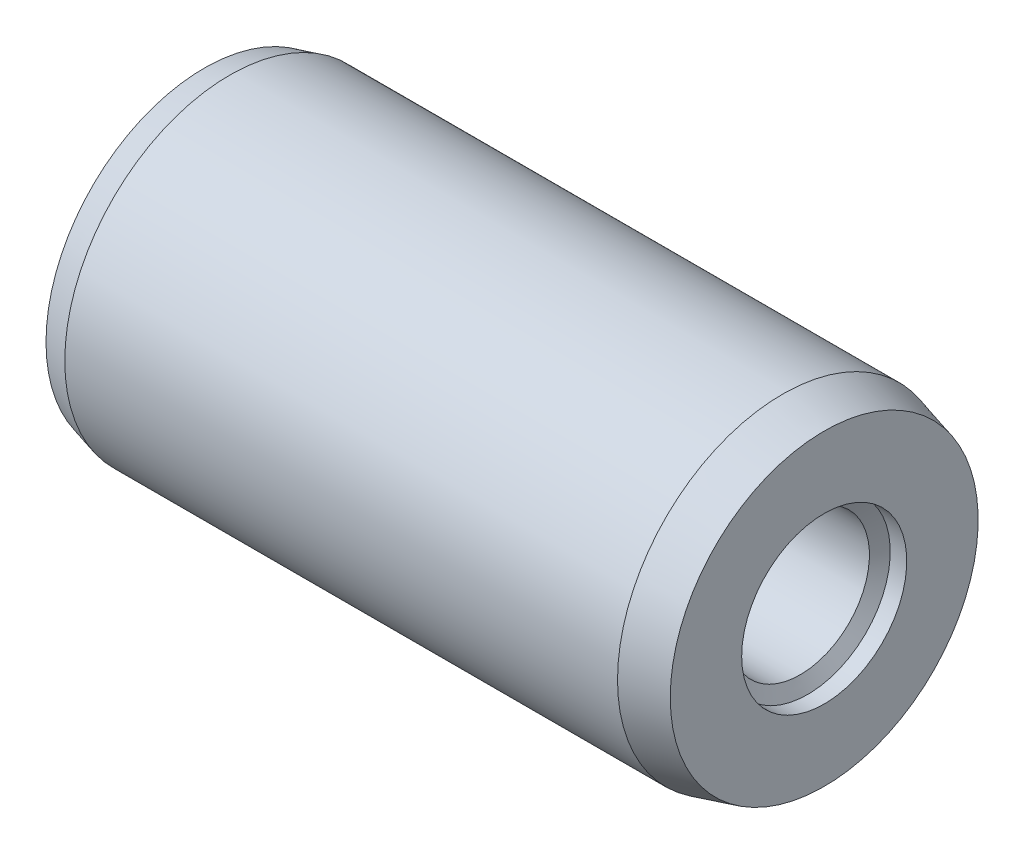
ISO-10303-21;
HEADER;
FILE_DESCRIPTION(('STEP AP214'),'2;1');
FILE_NAME('part.step','',(''),(''),'','','');
FILE_SCHEMA(('AUTOMOTIVE_DESIGN { 1 0 10303 214 1 1 1 1 }'));
ENDSEC;
DATA;
#1=APPLICATION_CONTEXT('core data for automotive mechanical design processes');
#2=APPLICATION_PROTOCOL_DEFINITION('international standard','automotive_design',2000,#1);
#3=PRODUCT_CONTEXT('',#1,'mechanical');
#4=PRODUCT('Part','Part','',(#3));
#5=PRODUCT_RELATED_PRODUCT_CATEGORY('part','',(#4));
#6=PRODUCT_DEFINITION_FORMATION('','',#4);
#7=PRODUCT_DEFINITION_CONTEXT('part definition',#1,'design');
#8=PRODUCT_DEFINITION('design','',#6,#7);
#9=PRODUCT_DEFINITION_SHAPE('','',#8);
#10=(LENGTH_UNIT() NAMED_UNIT(*) SI_UNIT(.MILLI.,.METRE.));
#11=(NAMED_UNIT(*) PLANE_ANGLE_UNIT() SI_UNIT($,.RADIAN.));
#12=(NAMED_UNIT(*) SI_UNIT($,.STERADIAN.) SOLID_ANGLE_UNIT());
#13=UNCERTAINTY_MEASURE_WITH_UNIT(LENGTH_MEASURE(1.E-05),#10,'distance_accuracy_value','');
#14=(GEOMETRIC_REPRESENTATION_CONTEXT(3) GLOBAL_UNCERTAINTY_ASSIGNED_CONTEXT((#13)) GLOBAL_UNIT_ASSIGNED_CONTEXT((#10,
#11,#12)) REPRESENTATION_CONTEXT('',''));
#15=CARTESIAN_POINT('',(0.,0.,0.));
#16=DIRECTION('',(0.,0.,1.));
#17=DIRECTION('',(1.,0.,0.));
#18=AXIS2_PLACEMENT_3D('',#15,#16,#17);
#19=CARTESIAN_POINT('',(10.,0.,0.));
#20=DIRECTION('',(1.,0.,0.));
#21=DIRECTION('',(0.,0.,-1.));
#22=AXIS2_PLACEMENT_3D('',#19,#20,#21);
#23=CONICAL_SURFACE('',#22,25.,0.261799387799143);
#24=CARTESIAN_POINT('',(10.,0.,0.));
#25=DIRECTION('',(-1.,0.,0.));
#26=DIRECTION('',(0.,0.,1.));
#27=AXIS2_PLACEMENT_3D('',#24,#25,#26);
#28=CIRCLE('',#27,25.);
#29=CARTESIAN_POINT('',(10.,0.,25.));
#30=VERTEX_POINT('',#29);
#31=EDGE_CURVE('E11',#30,#30,#28,.T.);
#32=ORIENTED_EDGE('',*,*,#31,.T.);
#33=EDGE_LOOP('',(#32));
#34=FACE_BOUND('',#33,.T.);
#35=CARTESIAN_POINT('',(6.1140356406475,0.,0.));
#36=DIRECTION('',(-1.,0.,0.));
#37=DIRECTION('',(0.,0.,1.));
#38=AXIS2_PLACEMENT_3D('',#35,#36,#37);
#39=CIRCLE('',#38,23.9587589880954);
#40=CARTESIAN_POINT('',(6.1140356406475,0.,23.9587589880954));
#41=VERTEX_POINT('',#40);
#42=EDGE_CURVE('E55',#41,#41,#39,.T.);
#43=ORIENTED_EDGE('',*,*,#42,.F.);
#44=EDGE_LOOP('',(#43));
#45=FACE_BOUND('',#44,.T.);
#46=ADVANCED_FACE('F35',(#34,#45),#23,.T.);
#47=CARTESIAN_POINT('',(-10.,0.,0.));
#48=DIRECTION('',(-1.,0.,0.));
#49=DIRECTION('',(0.,0.,1.));
#50=AXIS2_PLACEMENT_3D('',#47,#48,#49);
#51=CYLINDRICAL_SURFACE('',#50,25.);
#52=ORIENTED_EDGE('',*,*,#31,.F.);
#53=EDGE_LOOP('',(#52));
#54=FACE_BOUND('',#53,.T.);
#55=CARTESIAN_POINT('',(93.7,0.,0.));
#56=DIRECTION('',(-1.,0.,0.));
#57=DIRECTION('',(0.,0.,1.));
#58=AXIS2_PLACEMENT_3D('',#55,#56,#57);
#59=CIRCLE('',#58,25.);
#60=CARTESIAN_POINT('',(93.7,0.,25.));
#61=VERTEX_POINT('',#60);
#62=EDGE_CURVE('E42',#61,#61,#59,.T.);
#63=ORIENTED_EDGE('',*,*,#62,.T.);
#64=EDGE_LOOP('',(#63));
#65=FACE_BOUND('',#64,.T.);
#66=ADVANCED_FACE('F76',(#54,#65),#51,.T.);
#67=CARTESIAN_POINT('',(100.,0.,0.));
#68=DIRECTION('',(-1.,0.,0.));
#69=DIRECTION('',(0.,0.,1.));
#70=AXIS2_PLACEMENT_3D('',#67,#68,#69);
#71=CONICAL_SURFACE('',#70,23.3119200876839,0.261799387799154);
#72=ORIENTED_EDGE('',*,*,#62,.F.);
#73=EDGE_LOOP('',(#72));
#74=FACE_BOUND('',#73,.T.);
#75=CARTESIAN_POINT('',(100.,0.,0.));
#76=DIRECTION('',(-1.,0.,0.));
#77=DIRECTION('',(0.,0.,1.));
#78=AXIS2_PLACEMENT_3D('',#75,#76,#77);
#79=CIRCLE('',#78,23.3119200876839);
#80=CARTESIAN_POINT('',(100.,0.,23.3119200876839));
#81=VERTEX_POINT('',#80);
#82=EDGE_CURVE('E71',#81,#81,#79,.T.);
#83=ORIENTED_EDGE('',*,*,#82,.T.);
#84=EDGE_LOOP('',(#83));
#85=FACE_BOUND('',#84,.T.);
#86=ADVANCED_FACE('F78',(#74,#85),#71,.T.);
#87=CARTESIAN_POINT('',(100.,23.3119200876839,0.));
#88=DIRECTION('',(-1.,0.,0.));
#89=DIRECTION('',(0.,0.,1.));
#90=AXIS2_PLACEMENT_3D('',#87,#88,#89);
#91=PLANE('',#90);
#92=ORIENTED_EDGE('',*,*,#82,.F.);
#93=EDGE_LOOP('',(#92));
#94=FACE_BOUND('',#93,.T.);
#95=CARTESIAN_POINT('',(100.,0.,0.));
#96=DIRECTION('',(-1.,0.,0.));
#97=DIRECTION('',(0.,0.,1.));
#98=AXIS2_PLACEMENT_3D('',#95,#96,#97);
#99=CIRCLE('',#98,12.5);
#100=CARTESIAN_POINT('',(100.,0.,12.5));
#101=VERTEX_POINT('',#100);
#102=EDGE_CURVE('E68',#101,#101,#99,.T.);
#103=ORIENTED_EDGE('',*,*,#102,.T.);
#104=EDGE_LOOP('',(#103));
#105=FACE_BOUND('',#104,.T.);
#106=ADVANCED_FACE('F81',(#94,#105),#91,.F.);
#107=CARTESIAN_POINT('',(-10.,0.,0.));
#108=DIRECTION('',(-1.,0.,0.));
#109=DIRECTION('',(0.,0.,1.));
#110=AXIS2_PLACEMENT_3D('',#107,#108,#109);
#111=CYLINDRICAL_SURFACE('',#110,12.5);
#112=ORIENTED_EDGE('',*,*,#102,.F.);
#113=EDGE_LOOP('',(#112));
#114=FACE_BOUND('',#113,.T.);
#115=CARTESIAN_POINT('',(97.5,0.,0.));
#116=DIRECTION('',(-1.,0.,0.));
#117=DIRECTION('',(0.,0.,1.));
#118=AXIS2_PLACEMENT_3D('',#115,#116,#117);
#119=CIRCLE('',#118,12.5);
#120=CARTESIAN_POINT('',(97.5,0.,12.5));
#121=VERTEX_POINT('',#120);
#122=EDGE_CURVE('E65',#121,#121,#119,.T.);
#123=ORIENTED_EDGE('',*,*,#122,.T.);
#124=EDGE_LOOP('',(#123));
#125=FACE_BOUND('',#124,.T.);
#126=ADVANCED_FACE('F87',(#114,#125),#111,.F.);
#127=CARTESIAN_POINT('',(96.3452994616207,0.,0.));
#128=DIRECTION('',(1.,0.,0.));
#129=DIRECTION('',(0.,0.,-1.));
#130=AXIS2_PLACEMENT_3D('',#127,#128,#129);
#131=CONICAL_SURFACE('',#130,10.5,1.04719755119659);
#132=ORIENTED_EDGE('',*,*,#122,.F.);
#133=EDGE_LOOP('',(#132));
#134=FACE_BOUND('',#133,.T.);
#135=CARTESIAN_POINT('',(96.3452994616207,0.,0.));
#136=DIRECTION('',(-1.,0.,0.));
#137=DIRECTION('',(0.,0.,1.));
#138=AXIS2_PLACEMENT_3D('',#135,#136,#137);
#139=CIRCLE('',#138,10.5);
#140=CARTESIAN_POINT('',(96.3452994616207,0.,10.5));
#141=VERTEX_POINT('',#140);
#142=EDGE_CURVE('E60',#141,#141,#139,.T.);
#143=ORIENTED_EDGE('',*,*,#142,.T.);
#144=EDGE_LOOP('',(#143));
#145=FACE_BOUND('',#144,.T.);
#146=ADVANCED_FACE('F93',(#134,#145),#131,.F.);
#147=CARTESIAN_POINT('',(-10.,0.,0.));
#148=DIRECTION('',(-1.,0.,0.));
#149=DIRECTION('',(0.,0.,1.));
#150=AXIS2_PLACEMENT_3D('',#147,#148,#149);
#151=CYLINDRICAL_SURFACE('',#150,10.5);
#152=ORIENTED_EDGE('',*,*,#142,.F.);
#153=EDGE_LOOP('',(#152));
#154=FACE_BOUND('',#153,.T.);
#155=CARTESIAN_POINT('',(50.,0.,0.));
#156=DIRECTION('',(-1.,0.,0.));
#157=DIRECTION('',(0.,0.,1.));
#158=AXIS2_PLACEMENT_3D('',#155,#156,#157);
#159=CIRCLE('',#158,10.5);
#160=CARTESIAN_POINT('',(50.,0.,10.5));
#161=VERTEX_POINT('',#160);
#162=EDGE_CURVE('E57',#161,#161,#159,.T.);
#163=ORIENTED_EDGE('',*,*,#162,.T.);
#164=EDGE_LOOP('',(#163));
#165=FACE_BOUND('',#164,.T.);
#166=ADVANCED_FACE('F99',(#154,#165),#151,.F.);
#167=CARTESIAN_POINT('',(43.6909635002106,0.,0.));
#168=DIRECTION('',(1.,0.,0.));
#169=DIRECTION('',(0.,0.,-1.));
#170=AXIS2_PLACEMENT_3D('',#167,#168,#169);
#171=CONICAL_SURFACE('',#170,0.,1.02974425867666);
#172=ORIENTED_EDGE('',*,*,#162,.F.);
#173=EDGE_LOOP('',(#172));
#174=FACE_BOUND('',#173,.T.);
#175=CARTESIAN_POINT('',(43.6909635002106,0.,0.));
#176=VERTEX_POINT('',#175);
#177=VERTEX_LOOP('',#176);
#178=FACE_BOUND('',#177,.T.);
#179=ADVANCED_FACE('F51',(#174,#178),#171,.F.);
#180=CARTESIAN_POINT('',(50.,0.,0.));
#181=DIRECTION('',(-1.,0.,0.));
#182=DIRECTION('',(0.,-1.,0.));
#183=AXIS2_PLACEMENT_3D('',#180,#181,#182);
#184=SPHERICAL_SURFACE('',#183,50.);
#185=CARTESIAN_POINT('',(0.,0.,0.));
#186=VERTEX_POINT('',#185);
#187=VERTEX_LOOP('',#186);
#188=FACE_BOUND('',#187,.T.);
#189=ORIENTED_EDGE('',*,*,#42,.T.);
#190=EDGE_LOOP('',(#189));
#191=FACE_BOUND('',#190,.T.);
#192=ADVANCED_FACE('F48',(#188,#191),#184,.T.);
#193=CLOSED_SHELL('',(#46,#66,#86,#106,#126,#146,#166,#179,#192));
#194=MANIFOLD_SOLID_BREP('B2',#193);
#195=ADVANCED_BREP_SHAPE_REPRESENTATION('',(#18,#194),#14);
#196=SHAPE_DEFINITION_REPRESENTATION(#9,#195);
ENDSEC;
END-ISO-10303-21;
